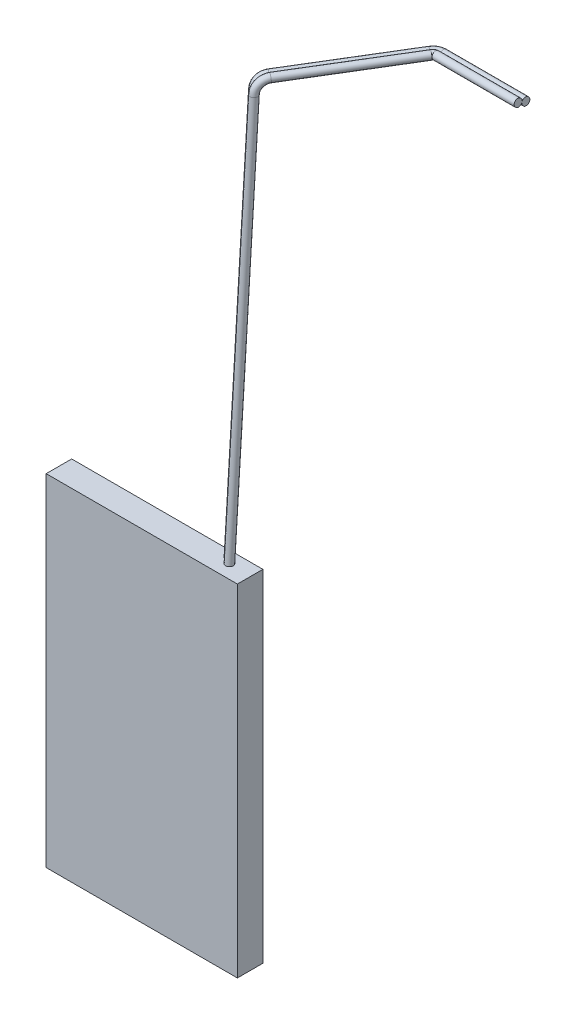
ISO-10303-21;
HEADER;
FILE_DESCRIPTION(('STEP AP214'),'2;1');
FILE_NAME('part.step','',(''),(''),'','','');
FILE_SCHEMA(('AUTOMOTIVE_DESIGN { 1 0 10303 214 1 1 1 1 }'));
ENDSEC;
DATA;
#1=APPLICATION_CONTEXT('core data for automotive mechanical design processes');
#2=APPLICATION_PROTOCOL_DEFINITION('international standard','automotive_design',2000,#1);
#3=PRODUCT_CONTEXT('',#1,'mechanical');
#4=PRODUCT('Part','Part','',(#3));
#5=PRODUCT_RELATED_PRODUCT_CATEGORY('part','',(#4));
#6=PRODUCT_DEFINITION_FORMATION('','',#4);
#7=PRODUCT_DEFINITION_CONTEXT('part definition',#1,'design');
#8=PRODUCT_DEFINITION('design','',#6,#7);
#9=PRODUCT_DEFINITION_SHAPE('','',#8);
#10=(LENGTH_UNIT() NAMED_UNIT(*) SI_UNIT(.MILLI.,.METRE.));
#11=(NAMED_UNIT(*) PLANE_ANGLE_UNIT() SI_UNIT($,.RADIAN.));
#12=(NAMED_UNIT(*) SI_UNIT($,.STERADIAN.) SOLID_ANGLE_UNIT());
#13=UNCERTAINTY_MEASURE_WITH_UNIT(LENGTH_MEASURE(1.E-05),#10,'distance_accuracy_value','');
#14=(GEOMETRIC_REPRESENTATION_CONTEXT(3) GLOBAL_UNCERTAINTY_ASSIGNED_CONTEXT((#13)) GLOBAL_UNIT_ASSIGNED_CONTEXT((#10,
#11,#12)) REPRESENTATION_CONTEXT('',''));
#15=CARTESIAN_POINT('',(0.,0.,0.));
#16=DIRECTION('',(0.,0.,1.));
#17=DIRECTION('',(1.,0.,0.));
#18=AXIS2_PLACEMENT_3D('',#15,#16,#17);
#19=CARTESIAN_POINT('',(-22.5,40.15,3.));
#20=DIRECTION('',(0.,-1.,0.));
#21=DIRECTION('',(0.,0.,-1.));
#22=AXIS2_PLACEMENT_3D('',#19,#20,#21);
#23=PLANE('',#22);
#24=DIRECTION('',(-1.,0.,0.));
#25=VECTOR('',#24,1.);
#26=CARTESIAN_POINT('',(-22.5,40.15,-3.));
#27=LINE('',#26,#25);
#28=CARTESIAN_POINT('',(22.5,40.15,-3.));
#29=VERTEX_POINT('',#28);
#30=CARTESIAN_POINT('',(-22.5,40.15,-3.));
#31=VERTEX_POINT('',#30);
#32=EDGE_CURVE('E317',#29,#31,#27,.T.);
#33=ORIENTED_EDGE('',*,*,#32,.T.);
#34=DIRECTION('',(0.,0.,-1.));
#35=VECTOR('',#34,1.);
#36=CARTESIAN_POINT('',(-22.5,40.15,3.));
#37=LINE('',#36,#35);
#38=CARTESIAN_POINT('',(-22.5,40.15,3.));
#39=VERTEX_POINT('',#38);
#40=EDGE_CURVE('E56',#39,#31,#37,.T.);
#41=ORIENTED_EDGE('',*,*,#40,.F.);
#42=DIRECTION('',(-1.,0.,0.));
#43=VECTOR('',#42,1.);
#44=CARTESIAN_POINT('',(-22.5,40.15,3.));
#45=LINE('',#44,#43);
#46=CARTESIAN_POINT('',(22.5,40.15,3.));
#47=VERTEX_POINT('',#46);
#48=EDGE_CURVE('E307',#47,#39,#45,.T.);
#49=ORIENTED_EDGE('',*,*,#48,.F.);
#50=DIRECTION('',(0.,0.,-1.));
#51=VECTOR('',#50,1.);
#52=CARTESIAN_POINT('',(22.5,40.15,3.));
#53=LINE('',#52,#51);
#54=EDGE_CURVE('E13',#47,#29,#53,.T.);
#55=ORIENTED_EDGE('',*,*,#54,.T.);
#56=EDGE_LOOP('',(#33,#41,#49,#55));
#57=FACE_BOUND('',#56,.T.);
#58=CARTESIAN_POINT('',(16.15,40.15,-1.476));
#59=DIRECTION('',(0.,1.,0.));
#60=DIRECTION('',(0.,0.,1.));
#61=AXIS2_PLACEMENT_3D('',#58,#59,#60);
#62=CIRCLE('',#61,0.889000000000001);
#63=CARTESIAN_POINT('',(16.8619729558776,40.15,-0.943632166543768));
#64=VERTEX_POINT('',#63);
#65=CARTESIAN_POINT('',(16.6823678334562,40.15,-0.764027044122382));
#66=VERTEX_POINT('',#65);
#67=EDGE_CURVE('E63',#64,#66,#62,.T.);
#68=ORIENTED_EDGE('',*,*,#67,.F.);
#69=DIRECTION('',(-0.707106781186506,0.,-0.707106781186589));
#70=VECTOR('',#69,1.);
#71=CARTESIAN_POINT('',(16.8619729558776,40.15,-0.943632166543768));
#72=LINE('',#71,#70);
#73=CARTESIAN_POINT('',(16.8748680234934,40.15,-0.930737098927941));
#74=VERTEX_POINT('',#73);
#75=EDGE_CURVE('E67',#74,#64,#72,.T.);
#76=ORIENTED_EDGE('',*,*,#75,.F.);
#77=CARTESIAN_POINT('',(17.4072358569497,40.15,-0.218764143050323));
#78=DIRECTION('',(0.,1.,0.));
#79=DIRECTION('',(0.,0.,1.));
#80=AXIS2_PLACEMENT_3D('',#77,#78,#79);
#81=CIRCLE('',#80,0.889000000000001);
#82=CARTESIAN_POINT('',(16.6952629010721,40.15,-0.751131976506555));
#83=VERTEX_POINT('',#82);
#84=EDGE_CURVE('E435',#83,#74,#81,.T.);
#85=ORIENTED_EDGE('',*,*,#84,.F.);
#86=DIRECTION('',(0.707106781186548,0.,0.707106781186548));
#87=VECTOR('',#86,1.);
#88=CARTESIAN_POINT('',(16.6823678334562,40.15,-0.764027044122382));
#89=LINE('',#88,#87);
#90=EDGE_CURVE('E574',#66,#83,#89,.T.);
#91=ORIENTED_EDGE('',*,*,#90,.F.);
#92=EDGE_LOOP('',(#68,#76,#85,#91));
#93=FACE_BOUND('',#92,.T.);
#94=ADVANCED_FACE('F48',(#57,#93),#23,.F.);
#95=CARTESIAN_POINT('',(22.5,-40.15,3.));
#96=DIRECTION('',(-1.,0.,0.));
#97=DIRECTION('',(0.,0.,1.));
#98=AXIS2_PLACEMENT_3D('',#95,#96,#97);
#99=PLANE('',#98);
#100=DIRECTION('',(0.,1.,0.));
#101=VECTOR('',#100,1.);
#102=CARTESIAN_POINT('',(22.5,-40.15,-3.));
#103=LINE('',#102,#101);
#104=CARTESIAN_POINT('',(22.5,-40.15,-3.));
#105=VERTEX_POINT('',#104);
#106=EDGE_CURVE('E303',#105,#29,#103,.T.);
#107=ORIENTED_EDGE('',*,*,#106,.T.);
#108=ORIENTED_EDGE('',*,*,#54,.F.);
#109=DIRECTION('',(0.,1.,0.));
#110=VECTOR('',#109,1.);
#111=CARTESIAN_POINT('',(22.5,-40.15,3.));
#112=LINE('',#111,#110);
#113=CARTESIAN_POINT('',(22.5,-40.15,3.));
#114=VERTEX_POINT('',#113);
#115=EDGE_CURVE('E304',#114,#47,#112,.T.);
#116=ORIENTED_EDGE('',*,*,#115,.F.);
#117=DIRECTION('',(0.,0.,-1.));
#118=VECTOR('',#117,1.);
#119=CARTESIAN_POINT('',(22.5,-40.15,3.));
#120=LINE('',#119,#118);
#121=EDGE_CURVE('E314',#114,#105,#120,.T.);
#122=ORIENTED_EDGE('',*,*,#121,.T.);
#123=EDGE_LOOP('',(#107,#108,#116,#122));
#124=FACE_BOUND('',#123,.T.);
#125=ADVANCED_FACE('F50',(#124),#99,.F.);
#126=CARTESIAN_POINT('',(-22.5,-40.15,3.));
#127=DIRECTION('',(1.,0.,0.));
#128=DIRECTION('',(0.,0.,-1.));
#129=AXIS2_PLACEMENT_3D('',#126,#127,#128);
#130=PLANE('',#129);
#131=DIRECTION('',(0.,-1.,0.));
#132=VECTOR('',#131,1.);
#133=CARTESIAN_POINT('',(-22.5,-40.15,-3.));
#134=LINE('',#133,#132);
#135=CARTESIAN_POINT('',(-22.5,-40.15,-3.));
#136=VERTEX_POINT('',#135);
#137=EDGE_CURVE('E319',#31,#136,#134,.T.);
#138=ORIENTED_EDGE('',*,*,#137,.T.);
#139=DIRECTION('',(0.,0.,-1.));
#140=VECTOR('',#139,1.);
#141=CARTESIAN_POINT('',(-22.5,-40.15,3.));
#142=LINE('',#141,#140);
#143=CARTESIAN_POINT('',(-22.5,-40.15,3.));
#144=VERTEX_POINT('',#143);
#145=EDGE_CURVE('E324',#144,#136,#142,.T.);
#146=ORIENTED_EDGE('',*,*,#145,.F.);
#147=DIRECTION('',(0.,-1.,0.));
#148=VECTOR('',#147,1.);
#149=CARTESIAN_POINT('',(-22.5,-40.15,3.));
#150=LINE('',#149,#148);
#151=EDGE_CURVE('E310',#39,#144,#150,.T.);
#152=ORIENTED_EDGE('',*,*,#151,.F.);
#153=ORIENTED_EDGE('',*,*,#40,.T.);
#154=EDGE_LOOP('',(#138,#146,#152,#153));
#155=FACE_BOUND('',#154,.T.);
#156=ADVANCED_FACE('F331',(#155),#130,.F.);
#157=CARTESIAN_POINT('',(-22.5,-40.15,3.));
#158=DIRECTION('',(0.,1.,0.));
#159=DIRECTION('',(0.,0.,1.));
#160=AXIS2_PLACEMENT_3D('',#157,#158,#159);
#161=PLANE('',#160);
#162=DIRECTION('',(1.,0.,0.));
#163=VECTOR('',#162,1.);
#164=CARTESIAN_POINT('',(-22.5,-40.15,-3.));
#165=LINE('',#164,#163);
#166=EDGE_CURVE('E308',#136,#105,#165,.T.);
#167=ORIENTED_EDGE('',*,*,#166,.T.);
#168=ORIENTED_EDGE('',*,*,#121,.F.);
#169=DIRECTION('',(1.,0.,0.));
#170=VECTOR('',#169,1.);
#171=CARTESIAN_POINT('',(-22.5,-40.15,3.));
#172=LINE('',#171,#170);
#173=EDGE_CURVE('E312',#144,#114,#172,.T.);
#174=ORIENTED_EDGE('',*,*,#173,.F.);
#175=ORIENTED_EDGE('',*,*,#145,.T.);
#176=EDGE_LOOP('',(#167,#168,#174,#175));
#177=FACE_BOUND('',#176,.T.);
#178=ADVANCED_FACE('F340',(#177),#161,.F.);
#179=CARTESIAN_POINT('',(0.,0.,3.));
#180=DIRECTION('',(0.,0.,-1.));
#181=DIRECTION('',(-1.,0.,0.));
#182=AXIS2_PLACEMENT_3D('',#179,#180,#181);
#183=PLANE('',#182);
#184=ORIENTED_EDGE('',*,*,#115,.T.);
#185=ORIENTED_EDGE('',*,*,#48,.T.);
#186=ORIENTED_EDGE('',*,*,#151,.T.);
#187=ORIENTED_EDGE('',*,*,#173,.T.);
#188=EDGE_LOOP('',(#184,#185,#186,#187));
#189=FACE_BOUND('',#188,.T.);
#190=ADVANCED_FACE('F346',(#189),#183,.F.);
#191=CARTESIAN_POINT('',(0.,0.,-3.));
#192=DIRECTION('',(0.,0.,-1.));
#193=DIRECTION('',(-1.,0.,0.));
#194=AXIS2_PLACEMENT_3D('',#191,#192,#193);
#195=PLANE('',#194);
#196=ORIENTED_EDGE('',*,*,#106,.F.);
#197=ORIENTED_EDGE('',*,*,#166,.F.);
#198=ORIENTED_EDGE('',*,*,#137,.F.);
#199=ORIENTED_EDGE('',*,*,#32,.F.);
#200=EDGE_LOOP('',(#196,#197,#198,#199));
#201=FACE_BOUND('',#200,.T.);
#202=ADVANCED_FACE('F337',(#201),#195,.T.);
#203=CARTESIAN_POINT('',(32.4689055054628,134.321354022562,-34.7280607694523));
#204=DIRECTION('',(0.,0.958667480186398,-0.284528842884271));
#205=DIRECTION('',(0.,0.284528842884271,0.958667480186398));
#206=AXIS2_PLACEMENT_3D('',#203,#204,#205);
#207=PLANE('',#206);
#208=DIRECTION('',(-0.0646236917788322,0.283934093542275,0.956663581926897));
#209=VECTOR('',#208,1.);
#210=CARTESIAN_POINT('',(32.4689055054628,134.321354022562,-34.7280607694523));
#211=LINE('',#210,#209);
#212=CARTESIAN_POINT('',(32.4689055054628,134.321354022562,-34.7280607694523));
#213=VERTEX_POINT('',#212);
#214=CARTESIAN_POINT('',(32.4677270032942,134.326531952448,-34.7106146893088));
#215=VERTEX_POINT('',#214);
#216=EDGE_CURVE('E262',#213,#215,#211,.T.);
#217=ORIENTED_EDGE('',*,*,#216,.T.);
#218=DIRECTION('',(1.,0.,0.));
#219=VECTOR('',#218,1.);
#220=CARTESIAN_POINT('',(32.4677270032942,134.326531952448,-34.7106146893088));
#221=LINE('',#220,#219);
#222=CARTESIAN_POINT('',(51.7968137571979,134.326531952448,-34.7106146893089));
#223=VERTEX_POINT('',#222);
#224=EDGE_CURVE('E297',#215,#223,#221,.T.);
#225=ORIENTED_EDGE('',*,*,#224,.T.);
#226=DIRECTION('',(-0.0646236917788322,0.283934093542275,0.956663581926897));
#227=VECTOR('',#226,1.);
#228=CARTESIAN_POINT('',(51.7979922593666,134.321354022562,-34.7280607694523));
#229=LINE('',#228,#227);
#230=CARTESIAN_POINT('',(51.7979922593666,134.321354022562,-34.7280607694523));
#231=VERTEX_POINT('',#230);
#232=EDGE_CURVE('E288',#231,#223,#229,.T.);
#233=ORIENTED_EDGE('',*,*,#232,.F.);
#234=DIRECTION('',(1.,0.,0.));
#235=VECTOR('',#234,1.);
#236=CARTESIAN_POINT('',(32.4689055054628,134.321354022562,-34.7280607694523));
#237=LINE('',#236,#235);
#238=EDGE_CURVE('E300',#213,#231,#237,.T.);
#239=ORIENTED_EDGE('',*,*,#238,.F.);
#240=EDGE_LOOP('',(#217,#225,#233,#239));
#241=FACE_BOUND('',#240,.T.);
#242=ADVANCED_FACE('F358',(#241),#207,.T.);
#243=CARTESIAN_POINT('',(32.4165163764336,134.454834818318,-33.8324137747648));
#244=DIRECTION('',(0.996917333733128,0.0611121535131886,0.0492050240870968));
#245=DIRECTION('',(-0.0771570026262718,0.877398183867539,0.473517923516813));
#246=AXIS2_PLACEMENT_3D('',#243,#244,#245);
#247=CIRCLE('',#246,0.889000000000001);
#248=DIRECTION('',(1.,0.,0.));
#249=VECTOR('',#248,1.);
#250=SURFACE_OF_LINEAR_EXTRUSION('',#247,#249);
#251=CARTESIAN_POINT('',(32.4790281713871,134.083480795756,-34.6377146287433));
#252=VERTEX_POINT('',#251);
#253=EDGE_CURVE('E369',#215,#252,#247,.T.);
#254=ORIENTED_EDGE('',*,*,#253,.T.);
#255=DIRECTION('',(1.,0.,0.));
#256=VECTOR('',#255,1.);
#257=CARTESIAN_POINT('',(32.4790281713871,134.083480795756,-34.6377146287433));
#258=LINE('',#257,#256);
#259=CARTESIAN_POINT('',(51.8081149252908,134.083480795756,-34.6377146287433));
#260=VERTEX_POINT('',#259);
#261=EDGE_CURVE('E294',#252,#260,#258,.T.);
#262=ORIENTED_EDGE('',*,*,#261,.T.);
#263=CARTESIAN_POINT('',(51.7456031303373,134.454834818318,-33.8324137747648));
#264=DIRECTION('',(0.996917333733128,0.0611121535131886,0.0492050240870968));
#265=DIRECTION('',(-0.0771570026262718,0.877398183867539,0.473517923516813));
#266=AXIS2_PLACEMENT_3D('',#263,#264,#265);
#267=CIRCLE('',#266,0.889000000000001);
#268=EDGE_CURVE('E285',#223,#260,#267,.T.);
#269=ORIENTED_EDGE('',*,*,#268,.F.);
#270=ORIENTED_EDGE('',*,*,#224,.F.);
#271=EDGE_LOOP('',(#254,#262,#269,#270));
#272=FACE_BOUND('',#271,.T.);
#273=ADVANCED_FACE('F363',(#272),#250,.T.);
#274=CARTESIAN_POINT('',(32.4802066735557,134.07830286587,-34.6551607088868));
#275=DIRECTION('',(0.,-0.958667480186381,0.284528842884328));
#276=DIRECTION('',(0.,-0.284528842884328,-0.958667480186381));
#277=AXIS2_PLACEMENT_3D('',#274,#275,#276);
#278=PLANE('',#277);
#279=DIRECTION('',(0.0646236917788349,-0.283934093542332,-0.95666358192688));
#280=VECTOR('',#279,1.);
#281=CARTESIAN_POINT('',(32.4802066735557,134.07830286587,-34.6551607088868));
#282=LINE('',#281,#280);
#283=CARTESIAN_POINT('',(32.4802066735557,134.07830286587,-34.6551607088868));
#284=VERTEX_POINT('',#283);
#285=EDGE_CURVE('E373',#252,#284,#282,.T.);
#286=ORIENTED_EDGE('',*,*,#285,.T.);
#287=DIRECTION('',(1.,0.,0.));
#288=VECTOR('',#287,1.);
#289=CARTESIAN_POINT('',(32.4802066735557,134.07830286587,-34.6551607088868));
#290=LINE('',#289,#288);
#291=CARTESIAN_POINT('',(51.8092934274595,134.07830286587,-34.6551607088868));
#292=VERTEX_POINT('',#291);
#293=EDGE_CURVE('E291',#284,#292,#290,.T.);
#294=ORIENTED_EDGE('',*,*,#293,.T.);
#295=DIRECTION('',(0.0646236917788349,-0.283934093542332,-0.95666358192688));
#296=VECTOR('',#295,1.);
#297=CARTESIAN_POINT('',(51.8092934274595,134.07830286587,-34.6551607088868));
#298=LINE('',#297,#296);
#299=EDGE_CURVE('E282',#260,#292,#298,.T.);
#300=ORIENTED_EDGE('',*,*,#299,.F.);
#301=ORIENTED_EDGE('',*,*,#261,.F.);
#302=EDGE_LOOP('',(#286,#294,#300,#301));
#303=FACE_BOUND('',#302,.T.);
#304=ADVANCED_FACE('F367',(#303),#278,.T.);
#305=CARTESIAN_POINT('',(32.5314173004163,133.95,-35.5333616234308));
#306=DIRECTION('',(0.996917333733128,0.0611121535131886,0.0492050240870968));
#307=DIRECTION('',(-0.0771570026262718,0.877398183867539,0.473517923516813));
#308=AXIS2_PLACEMENT_3D('',#305,#306,#307);
#309=CIRCLE('',#308,0.889000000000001);
#310=DIRECTION('',(1.,0.,0.));
#311=VECTOR('',#310,1.);
#312=SURFACE_OF_LINEAR_EXTRUSION('',#309,#311);
#313=EDGE_CURVE('E376',#284,#213,#309,.T.);
#314=ORIENTED_EDGE('',*,*,#313,.T.);
#315=ORIENTED_EDGE('',*,*,#238,.T.);
#316=CARTESIAN_POINT('',(51.8605040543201,133.95,-35.5333616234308));
#317=DIRECTION('',(0.996917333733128,0.0611121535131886,0.0492050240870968));
#318=DIRECTION('',(-0.0771570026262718,0.877398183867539,0.473517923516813));
#319=AXIS2_PLACEMENT_3D('',#316,#317,#318);
#320=CIRCLE('',#319,0.889000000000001);
#321=EDGE_CURVE('E279',#292,#231,#320,.T.);
#322=ORIENTED_EDGE('',*,*,#321,.F.);
#323=ORIENTED_EDGE('',*,*,#293,.F.);
#324=EDGE_LOOP('',(#314,#315,#322,#323));
#325=FACE_BOUND('',#324,.T.);
#326=ADVANCED_FACE('F382',(#325),#312,.T.);
#327=DIRECTION('',(0.783868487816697,0.283934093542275,0.55220614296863));
#328=VECTOR('',#327,1.);
#329=CARTESIAN_POINT('',(31.0166936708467,134.321354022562,-33.841124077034));
#330=LINE('',#329,#328);
#331=CARTESIAN_POINT('',(32.5314173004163,133.95,-32.9933616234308));
#332=DIRECTION('',(0.,-1.,0.));
#333=AXIS1_PLACEMENT('',#331,#332);
#334=SURFACE_OF_REVOLUTION('',#330,#333);
#335=CARTESIAN_POINT('',(31.0166936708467,134.321354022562,-33.841124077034));
#336=VERTEX_POINT('',#335);
#337=CARTESIAN_POINT('',(31.0309885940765,134.326531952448,-33.8310538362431));
#338=VERTEX_POINT('',#337);
#339=EDGE_CURVE('E403',#336,#338,#330,.T.);
#340=ORIENTED_EDGE('',*,*,#339,.T.);
#341=CARTESIAN_POINT('',(32.5314173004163,134.326531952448,-32.9933616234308));
#342=DIRECTION('',(0.,-1.,0.));
#343=DIRECTION('',(0.,0.,-1.));
#344=AXIS2_PLACEMENT_3D('',#341,#342,#343);
#345=CIRCLE('',#344,1.71843374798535);
#346=EDGE_CURVE('E273',#338,#215,#345,.T.);
#347=ORIENTED_EDGE('',*,*,#346,.T.);
#348=ORIENTED_EDGE('',*,*,#216,.F.);
#349=CARTESIAN_POINT('',(32.5314173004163,134.321354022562,-32.9933616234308));
#350=DIRECTION('',(0.,-1.,0.));
#351=DIRECTION('',(0.,0.,-1.));
#352=AXIS2_PLACEMENT_3D('',#349,#350,#351);
#353=CIRCLE('',#352,1.73582512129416);
#354=EDGE_CURVE('E276',#336,#213,#353,.T.);
#355=ORIENTED_EDGE('',*,*,#354,.F.);
#356=EDGE_LOOP('',(#340,#347,#348,#355));
#357=FACE_BOUND('',#356,.T.);
#358=ADVANCED_FACE('F253',(#357),#334,.F.);
#359=CARTESIAN_POINT('',(31.0309885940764,134.326531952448,-33.8310538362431));
#360=CARTESIAN_POINT('',(30.7926841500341,135.858617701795,-33.8792314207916));
#361=CARTESIAN_POINT('',(32.0353545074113,136.191640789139,-33.0124772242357));
#362=CARTESIAN_POINT('',(32.4516402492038,134.707252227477,-32.8401588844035));
#363=CARTESIAN_POINT('',(32.8679259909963,133.222863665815,-32.6678405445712));
#364=CARTESIAN_POINT('',(31.6848781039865,132.677239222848,-33.5099144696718));
#365=CARTESIAN_POINT('',(31.0991504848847,134.083480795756,-33.8028387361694));
#366=(BOUNDED_CURVE() B_SPLINE_CURVE(3,(#359,#360,#361,#362,#363,#364,#365),.UNSPECIFIED.,.F.,
.F.) B_SPLINE_CURVE_WITH_KNOTS((4,3,4),(0.,0.5,1.),
.UNSPECIFIED.) CURVE() GEOMETRIC_REPRESENTATION_ITEM() RATIONAL_B_SPLINE_CURVE((1.,
0.381074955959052,0.381074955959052,1.,0.381074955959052,0.381074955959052,1.)) REPRESENTATION_ITEM(''));
#367=CARTESIAN_POINT('',(32.5314173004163,133.95,-32.9933616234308));
#368=DIRECTION('',(0.,-1.,0.));
#369=AXIS1_PLACEMENT('',#367,#368);
#370=SURFACE_OF_REVOLUTION('',#366,#369);
#371=CARTESIAN_POINT('',(31.7547811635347,134.454834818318,-33.3310701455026));
#372=DIRECTION('',(0.559943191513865,0.0611121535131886,-0.826274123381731));
#373=DIRECTION('',(0.364523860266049,0.877398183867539,0.311921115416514));
#374=AXIS2_PLACEMENT_3D('',#371,#372,#373);
#375=CIRCLE('',#374,0.889000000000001);
#376=CARTESIAN_POINT('',(31.0991504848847,134.083480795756,-33.8028387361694));
#377=VERTEX_POINT('',#376);
#378=EDGE_CURVE('E407',#338,#377,#375,.T.);
#379=ORIENTED_EDGE('',*,*,#378,.T.);
#380=CARTESIAN_POINT('',(32.5314173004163,134.083480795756,-32.9933616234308));
#381=DIRECTION('',(0.,-1.,0.));
#382=DIRECTION('',(0.,0.,-1.));
#383=AXIS2_PLACEMENT_3D('',#380,#381,#382);
#384=CIRCLE('',#383,1.64518735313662);
#385=EDGE_CURVE('E270',#377,#252,#384,.T.);
#386=ORIENTED_EDGE('',*,*,#385,.T.);
#387=ORIENTED_EDGE('',*,*,#253,.F.);
#388=ORIENTED_EDGE('',*,*,#346,.F.);
#389=EDGE_LOOP('',(#379,#386,#387,#388));
#390=FACE_BOUND('',#389,.T.);
#391=ADVANCED_FACE('F248',(#390),#370,.F.);
#392=DIRECTION('',(-0.783868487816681,-0.283934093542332,-0.552206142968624));
#393=VECTOR('',#392,1.);
#394=CARTESIAN_POINT('',(31.0848555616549,134.07830286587,-33.8129089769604));
#395=LINE('',#394,#393);
#396=CARTESIAN_POINT('',(32.5314173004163,133.95,-32.9933616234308));
#397=DIRECTION('',(0.,-1.,0.));
#398=AXIS1_PLACEMENT('',#396,#397);
#399=SURFACE_OF_REVOLUTION('',#395,#398);
#400=CARTESIAN_POINT('',(31.0848555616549,134.07830286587,-33.8129089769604));
#401=VERTEX_POINT('',#400);
#402=EDGE_CURVE('E238',#377,#401,#395,.T.);
#403=ORIENTED_EDGE('',*,*,#402,.T.);
#404=CARTESIAN_POINT('',(32.5314173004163,134.07830286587,-32.9933616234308));
#405=DIRECTION('',(0.,-1.,0.));
#406=DIRECTION('',(0.,0.,-1.));
#407=AXIS2_PLACEMENT_3D('',#404,#405,#406);
#408=CIRCLE('',#407,1.66258796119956);
#409=EDGE_CURVE('E264',#401,#284,#408,.T.);
#410=ORIENTED_EDGE('',*,*,#409,.T.);
#411=ORIENTED_EDGE('',*,*,#285,.F.);
#412=ORIENTED_EDGE('',*,*,#385,.F.);
#413=EDGE_LOOP('',(#403,#410,#411,#412));
#414=FACE_BOUND('',#413,.T.);
#415=ADVANCED_FACE('F244',(#414),#399,.F.);
#416=CARTESIAN_POINT('',(30.3610629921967,133.95,-34.3128926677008));
#417=DIRECTION('',(0.559943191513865,0.0611121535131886,-0.826274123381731));
#418=DIRECTION('',(0.364523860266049,0.877398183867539,0.311921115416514));
#419=AXIS2_PLACEMENT_3D('',#416,#417,#418);
#420=CIRCLE('',#419,0.889000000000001);
#421=CARTESIAN_POINT('',(32.5314173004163,133.95,-32.9933616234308));
#422=DIRECTION('',(0.,-1.,0.));
#423=AXIS1_PLACEMENT('',#421,#422);
#424=SURFACE_OF_REVOLUTION('',#420,#423);
#425=EDGE_CURVE('E171',#401,#336,#420,.T.);
#426=ORIENTED_EDGE('',*,*,#425,.T.);
#427=ORIENTED_EDGE('',*,*,#354,.T.);
#428=ORIENTED_EDGE('',*,*,#313,.F.);
#429=ORIENTED_EDGE('',*,*,#409,.F.);
#430=EDGE_LOOP('',(#426,#427,#428,#429));
#431=FACE_BOUND('',#430,.T.);
#432=ADVANCED_FACE('F241',(#431),#424,.F.);
#433=CARTESIAN_POINT('',(16.710715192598,134.321354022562,-10.3107629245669));
#434=DIRECTION('',(-0.2431214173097,0.958667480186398,-0.147812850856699));
#435=DIRECTION('',(-0.969315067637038,-0.245821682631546,0.));
#436=AXIS2_PLACEMENT_3D('',#433,#434,#435);
#437=PLANE('',#436);
#438=DIRECTION('',(0.783868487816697,0.283934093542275,0.55220614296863));
#439=VECTOR('',#438,1.);
#440=CARTESIAN_POINT('',(16.710715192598,134.321354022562,-10.3107629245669));
#441=LINE('',#440,#439);
#442=CARTESIAN_POINT('',(16.710715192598,134.321354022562,-10.3107629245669));
#443=VERTEX_POINT('',#442);
#444=CARTESIAN_POINT('',(16.7250101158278,134.326531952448,-10.3006926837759));
#445=VERTEX_POINT('',#444);
#446=EDGE_CURVE('E168',#443,#445,#441,.T.);
#447=ORIENTED_EDGE('',*,*,#446,.T.);
#448=DIRECTION('',(0.51950041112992,0.,-0.854470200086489));
#449=VECTOR('',#448,1.);
#450=CARTESIAN_POINT('',(16.7250101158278,134.326531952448,-10.3006926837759));
#451=LINE('',#450,#449);
#452=EDGE_CURVE('E404',#445,#338,#451,.T.);
#453=ORIENTED_EDGE('',*,*,#452,.T.);
#454=ORIENTED_EDGE('',*,*,#339,.F.);
#455=DIRECTION('',(0.51950041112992,0.,-0.854470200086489));
#456=VECTOR('',#455,1.);
#457=CARTESIAN_POINT('',(16.710715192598,134.321354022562,-10.3107629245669));
#458=LINE('',#457,#456);
#459=EDGE_CURVE('E380',#443,#336,#458,.T.);
#460=ORIENTED_EDGE('',*,*,#459,.F.);
#461=EDGE_LOOP('',(#447,#453,#454,#460));
#462=FACE_BOUND('',#461,.T.);
#463=ADVANCED_FACE('F222',(#462),#437,.T.);
#464=CARTESIAN_POINT('',(17.448802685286,134.454834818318,-9.80070899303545));
#465=DIRECTION('',(0.559943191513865,0.0611121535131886,-0.826274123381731));
#466=DIRECTION('',(0.364523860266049,0.877398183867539,0.311921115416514));
#467=AXIS2_PLACEMENT_3D('',#464,#465,#466);
#468=CIRCLE('',#467,0.889000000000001);
#469=DIRECTION('',(0.51950041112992,0.,-0.854470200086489));
#470=VECTOR('',#469,1.);
#471=SURFACE_OF_LINEAR_EXTRUSION('',#468,#470);
#472=CARTESIAN_POINT('',(16.793172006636,134.083480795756,-10.2724775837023));
#473=VERTEX_POINT('',#472);
#474=EDGE_CURVE('E225',#445,#473,#468,.T.);
#475=ORIENTED_EDGE('',*,*,#474,.T.);
#476=DIRECTION('',(0.51950041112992,0.,-0.854470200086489));
#477=VECTOR('',#476,1.);
#478=CARTESIAN_POINT('',(16.793172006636,134.083480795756,-10.2724775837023));
#479=LINE('',#478,#477);
#480=EDGE_CURVE('E411',#473,#377,#479,.T.);
#481=ORIENTED_EDGE('',*,*,#480,.T.);
#482=ORIENTED_EDGE('',*,*,#378,.F.);
#483=ORIENTED_EDGE('',*,*,#452,.F.);
#484=EDGE_LOOP('',(#475,#481,#482,#483));
#485=FACE_BOUND('',#484,.T.);
#486=ADVANCED_FACE('F218',(#485),#471,.T.);
#487=CARTESIAN_POINT('',(16.7788770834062,134.07830286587,-10.2825478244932));
#488=DIRECTION('',(0.243121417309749,-0.958667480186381,0.147812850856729));
#489=DIRECTION('',(0.969315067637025,0.245821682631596,0.));
#490=AXIS2_PLACEMENT_3D('',#487,#488,#489);
#491=PLANE('',#490);
#492=DIRECTION('',(-0.783868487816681,-0.283934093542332,-0.552206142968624));
#493=VECTOR('',#492,1.);
#494=CARTESIAN_POINT('',(16.7788770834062,134.07830286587,-10.2825478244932));
#495=LINE('',#494,#493);
#496=CARTESIAN_POINT('',(16.7788770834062,134.07830286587,-10.2825478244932));
#497=VERTEX_POINT('',#496);
#498=EDGE_CURVE('E200',#473,#497,#495,.T.);
#499=ORIENTED_EDGE('',*,*,#498,.T.);
#500=DIRECTION('',(0.51950041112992,0.,-0.854470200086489));
#501=VECTOR('',#500,1.);
#502=CARTESIAN_POINT('',(16.7788770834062,134.07830286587,-10.2825478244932));
#503=LINE('',#502,#501);
#504=EDGE_CURVE('E406',#497,#401,#503,.T.);
#505=ORIENTED_EDGE('',*,*,#504,.T.);
#506=ORIENTED_EDGE('',*,*,#402,.F.);
#507=ORIENTED_EDGE('',*,*,#480,.F.);
#508=EDGE_LOOP('',(#499,#505,#506,#507));
#509=FACE_BOUND('',#508,.T.);
#510=ADVANCED_FACE('F213',(#509),#491,.T.);
#511=CARTESIAN_POINT('',(16.0550845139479,133.95,-10.7825315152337));
#512=DIRECTION('',(0.559943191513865,0.0611121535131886,-0.826274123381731));
#513=DIRECTION('',(0.364523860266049,0.877398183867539,0.311921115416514));
#514=AXIS2_PLACEMENT_3D('',#511,#512,#513);
#515=CIRCLE('',#514,0.889000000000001);
#516=DIRECTION('',(0.51950041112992,0.,-0.854470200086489));
#517=VECTOR('',#516,1.);
#518=SURFACE_OF_LINEAR_EXTRUSION('',#515,#517);
#519=EDGE_CURVE('E196',#497,#443,#515,.T.);
#520=ORIENTED_EDGE('',*,*,#519,.T.);
#521=ORIENTED_EDGE('',*,*,#459,.T.);
#522=ORIENTED_EDGE('',*,*,#425,.F.);
#523=ORIENTED_EDGE('',*,*,#504,.F.);
#524=EDGE_LOOP('',(#520,#521,#522,#523));
#525=FACE_BOUND('',#524,.T.);
#526=ADVANCED_FACE('F209',(#525),#518,.T.);
#527=DIRECTION('',(0.707106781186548,0.,0.707106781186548));
#528=VECTOR('',#527,1.);
#529=CARTESIAN_POINT('',(15.3771225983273,131.561952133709,-7.83890877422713));
#530=LINE('',#529,#528);
#531=CARTESIAN_POINT('',(16.1686720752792,131.413480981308,-10.7134726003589));
#532=DIRECTION('',(-0.853299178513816,-0.0523359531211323,-0.518788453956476));
#533=AXIS1_PLACEMENT('',#531,#532);
#534=SURFACE_OF_REVOLUTION('',#530,#533);
#535=CARTESIAN_POINT('',(15.3771225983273,131.561952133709,-7.83890877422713));
#536=VERTEX_POINT('',#535);
#537=CARTESIAN_POINT('',(15.3900176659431,131.561952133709,-7.82601370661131));
#538=VERTEX_POINT('',#537);
#539=EDGE_CURVE('E165',#536,#538,#530,.T.);
#540=ORIENTED_EDGE('',*,*,#539,.T.);
#541=CARTESIAN_POINT('',(16.8865744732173,131.457512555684,-10.2770026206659));
#542=DIRECTION('',(-0.853299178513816,-0.0523359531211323,-0.518788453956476));
#543=DIRECTION('',(-0.51950041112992,0.,0.854470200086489));
#544=AXIS2_PLACEMENT_3D('',#541,#542,#543);
#545=CIRCLE('',#544,2.87366256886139);
#546=EDGE_CURVE('E172',#538,#445,#545,.T.);
#547=ORIENTED_EDGE('',*,*,#546,.T.);
#548=ORIENTED_EDGE('',*,*,#446,.F.);
#549=CARTESIAN_POINT('',(16.8714769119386,131.456586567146,-10.2861816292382));
#550=DIRECTION('',(-0.853299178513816,-0.0523359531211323,-0.518788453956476));
#551=DIRECTION('',(-0.51950041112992,0.,0.854470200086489));
#552=AXIS2_PLACEMENT_3D('',#549,#550,#551);
#553=CIRCLE('',#552,2.86937992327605);
#554=EDGE_CURVE('E160',#536,#443,#553,.T.);
#555=ORIENTED_EDGE('',*,*,#554,.F.);
#556=EDGE_LOOP('',(#540,#547,#548,#555));
#557=FACE_BOUND('',#556,.T.);
#558=ADVANCED_FACE('F162',(#557),#534,.F.);
#559=CARTESIAN_POINT('',(16.1019906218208,131.561952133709,-7.29364587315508));
#560=DIRECTION('',(0.,1.,0.));
#561=DIRECTION('',(0.,0.,1.));
#562=AXIS2_PLACEMENT_3D('',#559,#560,#561);
#563=CIRCLE('',#562,0.889000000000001);
#564=CARTESIAN_POINT('',(16.1686720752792,131.413480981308,-10.7134726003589));
#565=DIRECTION('',(-0.853299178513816,-0.0523359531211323,-0.518788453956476));
#566=AXIS1_PLACEMENT('',#564,#565);
#567=SURFACE_OF_REVOLUTION('',#563,#566);
#568=CARTESIAN_POINT('',(15.5696227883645,131.561952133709,-8.00561882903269));
#569=VERTEX_POINT('',#568);
#570=EDGE_CURVE('E192',#538,#569,#563,.T.);
#571=ORIENTED_EDGE('',*,*,#570,.T.);
#572=CARTESIAN_POINT('',(16.9378405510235,131.460656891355,-10.2458338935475));
#573=DIRECTION('',(-0.853299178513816,-0.0523359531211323,-0.518788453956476));
#574=DIRECTION('',(-0.51950041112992,0.,0.854470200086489));
#575=AXIS2_PLACEMENT_3D('',#572,#573,#574);
#576=CIRCLE('',#575,2.62694577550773);
#577=EDGE_CURVE('E231',#569,#473,#576,.T.);
#578=ORIENTED_EDGE('',*,*,#577,.T.);
#579=ORIENTED_EDGE('',*,*,#474,.F.);
#580=ORIENTED_EDGE('',*,*,#546,.F.);
#581=EDGE_LOOP('',(#571,#578,#579,#580));
#582=FACE_BOUND('',#581,.T.);
#583=ADVANCED_FACE('F427',(#582),#567,.F.);
#584=DIRECTION('',(-0.707106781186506,0.,-0.707106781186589));
#585=VECTOR('',#584,1.);
#586=CARTESIAN_POINT('',(15.5567277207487,131.561952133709,-8.01851389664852));
#587=LINE('',#586,#585);
#588=CARTESIAN_POINT('',(16.1686720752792,131.413480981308,-10.7134726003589));
#589=DIRECTION('',(-0.853299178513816,-0.0523359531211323,-0.518788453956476));
#590=AXIS1_PLACEMENT('',#588,#589);
#591=SURFACE_OF_REVOLUTION('',#587,#590);
#592=CARTESIAN_POINT('',(15.5567277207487,131.561952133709,-8.01851389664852));
#593=VERTEX_POINT('',#592);
#594=EDGE_CURVE('E430',#569,#593,#587,.T.);
#595=ORIENTED_EDGE('',*,*,#594,.T.);
#596=CARTESIAN_POINT('',(16.9227429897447,131.459730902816,-10.2550129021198));
#597=DIRECTION('',(-0.853299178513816,-0.0523359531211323,-0.518788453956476));
#598=DIRECTION('',(-0.51950041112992,0.,0.854470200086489));
#599=AXIS2_PLACEMENT_3D('',#596,#597,#598);
#600=CIRCLE('',#599,2.62266557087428);
#601=EDGE_CURVE('E178',#593,#497,#600,.T.);
#602=ORIENTED_EDGE('',*,*,#601,.T.);
#603=ORIENTED_EDGE('',*,*,#498,.F.);
#604=ORIENTED_EDGE('',*,*,#577,.F.);
#605=EDGE_LOOP('',(#595,#602,#603,#604));
#606=FACE_BOUND('',#605,.T.);
#607=ADVANCED_FACE('F425',(#606),#591,.F.);
#608=CARTESIAN_POINT('',(14.8447547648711,131.561952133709,-8.55088173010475));
#609=DIRECTION('',(0.,1.,0.));
#610=DIRECTION('',(0.,0.,1.));
#611=AXIS2_PLACEMENT_3D('',#608,#609,#610);
#612=CIRCLE('',#611,0.889000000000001);
#613=CARTESIAN_POINT('',(16.1686720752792,131.413480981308,-10.7134726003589));
#614=DIRECTION('',(-0.853299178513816,-0.0523359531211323,-0.518788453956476));
#615=AXIS1_PLACEMENT('',#613,#614);
#616=SURFACE_OF_REVOLUTION('',#612,#615);
#617=EDGE_CURVE('E175',#593,#536,#612,.T.);
#618=ORIENTED_EDGE('',*,*,#617,.T.);
#619=ORIENTED_EDGE('',*,*,#554,.T.);
#620=ORIENTED_EDGE('',*,*,#519,.F.);
#621=ORIENTED_EDGE('',*,*,#601,.F.);
#622=EDGE_LOOP('',(#618,#619,#620,#621));
#623=FACE_BOUND('',#622,.T.);
#624=ADVANCED_FACE('F176',(#623),#616,.F.);
#625=DIRECTION('',(0.0142346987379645,-0.996917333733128,0.0771570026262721));
#626=VECTOR('',#625,1.);
#627=SURFACE_OF_LINEAR_EXTRUSION('',#612,#626);
#628=ORIENTED_EDGE('',*,*,#67,.T.);
#629=DIRECTION('',(0.0142346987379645,-0.996917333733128,0.0771570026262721));
#630=VECTOR('',#629,1.);
#631=CARTESIAN_POINT('',(15.3771225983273,131.561952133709,-7.83890877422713));
#632=LINE('',#631,#630);
#633=EDGE_CURVE('E188',#536,#66,#632,.T.);
#634=ORIENTED_EDGE('',*,*,#633,.F.);
#635=ORIENTED_EDGE('',*,*,#617,.F.);
#636=DIRECTION('',(0.0142346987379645,-0.996917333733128,0.0771570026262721));
#637=VECTOR('',#636,1.);
#638=CARTESIAN_POINT('',(15.5567277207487,131.561952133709,-8.01851389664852));
#639=LINE('',#638,#637);
#640=EDGE_CURVE('E438',#593,#64,#639,.T.);
#641=ORIENTED_EDGE('',*,*,#640,.T.);
#642=EDGE_LOOP('',(#628,#634,#635,#641));
#643=FACE_BOUND('',#642,.T.);
#644=ADVANCED_FACE('F194',(#643),#627,.F.);
#645=CARTESIAN_POINT('',(15.3771225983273,131.561952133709,-7.83890877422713));
#646=DIRECTION('',(0.706403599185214,-0.0445859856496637,-0.706403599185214));
#647=DIRECTION('',(-0.707106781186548,0.,-0.707106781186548));
#648=AXIS2_PLACEMENT_3D('',#645,#646,#647);
#649=PLANE('',#648);
#650=ORIENTED_EDGE('',*,*,#90,.T.);
#651=DIRECTION('',(0.0142346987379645,-0.996917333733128,0.0771570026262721));
#652=VECTOR('',#651,1.);
#653=CARTESIAN_POINT('',(15.3900176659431,131.561952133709,-7.82601370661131));
#654=LINE('',#653,#652);
#655=EDGE_CURVE('E190',#538,#83,#654,.T.);
#656=ORIENTED_EDGE('',*,*,#655,.F.);
#657=ORIENTED_EDGE('',*,*,#539,.F.);
#658=ORIENTED_EDGE('',*,*,#633,.T.);
#659=EDGE_LOOP('',(#650,#656,#657,#658));
#660=FACE_BOUND('',#659,.T.);
#661=ADVANCED_FACE('F187',(#660),#649,.F.);
#662=DIRECTION('',(0.0142346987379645,-0.996917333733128,0.0771570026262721));
#663=VECTOR('',#662,1.);
#664=SURFACE_OF_LINEAR_EXTRUSION('',#563,#663);
#665=ORIENTED_EDGE('',*,*,#84,.T.);
#666=DIRECTION('',(0.0142346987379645,-0.996917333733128,0.0771570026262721));
#667=VECTOR('',#666,1.);
#668=CARTESIAN_POINT('',(15.5696227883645,131.561952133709,-8.00561882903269));
#669=LINE('',#668,#667);
#670=EDGE_CURVE('E202',#569,#74,#669,.T.);
#671=ORIENTED_EDGE('',*,*,#670,.F.);
#672=ORIENTED_EDGE('',*,*,#570,.F.);
#673=ORIENTED_EDGE('',*,*,#655,.T.);
#674=EDGE_LOOP('',(#665,#671,#672,#673));
#675=FACE_BOUND('',#674,.T.);
#676=ADVANCED_FACE('F434',(#675),#664,.F.);
#677=CARTESIAN_POINT('',(15.5567277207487,131.561952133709,-8.01851389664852));
#678=DIRECTION('',(-0.706403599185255,0.0445859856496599,0.706403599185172));
#679=DIRECTION('',(0.707106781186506,0.,0.707106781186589));
#680=AXIS2_PLACEMENT_3D('',#677,#678,#679);
#681=PLANE('',#680);
#682=ORIENTED_EDGE('',*,*,#75,.T.);
#683=ORIENTED_EDGE('',*,*,#640,.F.);
#684=ORIENTED_EDGE('',*,*,#594,.F.);
#685=ORIENTED_EDGE('',*,*,#670,.T.);
#686=EDGE_LOOP('',(#682,#683,#684,#685));
#687=FACE_BOUND('',#686,.T.);
#688=ADVANCED_FACE('F440',(#687),#681,.F.);
#689=CARTESIAN_POINT('',(51.8605040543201,133.95,-35.5333616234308));
#690=DIRECTION('',(0.996917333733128,0.0611121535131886,0.0492050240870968));
#691=DIRECTION('',(-0.0771570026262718,0.877398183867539,0.473517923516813));
#692=AXIS2_PLACEMENT_3D('',#689,#690,#691);
#693=PLANE('',#692);
#694=ORIENTED_EDGE('',*,*,#321,.T.);
#695=ORIENTED_EDGE('',*,*,#232,.T.);
#696=ORIENTED_EDGE('',*,*,#268,.T.);
#697=ORIENTED_EDGE('',*,*,#299,.T.);
#698=EDGE_LOOP('',(#694,#695,#696,#697));
#699=FACE_BOUND('',#698,.T.);
#700=ADVANCED_FACE('F562',(#699),#693,.T.);
#701=CLOSED_SHELL('',(#94,#125,#156,#178,#190,#202,#242,#273,#304,#326,#358,#391,#415,#432,#463,
#486,#510,#526,#558,#583,#607,#624,#644,#661,#676,#688,#700));
#702=MANIFOLD_SOLID_BREP('B2',#701);
#703=ADVANCED_BREP_SHAPE_REPRESENTATION('',(#18,#702),#14);
#704=SHAPE_DEFINITION_REPRESENTATION(#9,#703);
ENDSEC;
END-ISO-10303-21;
